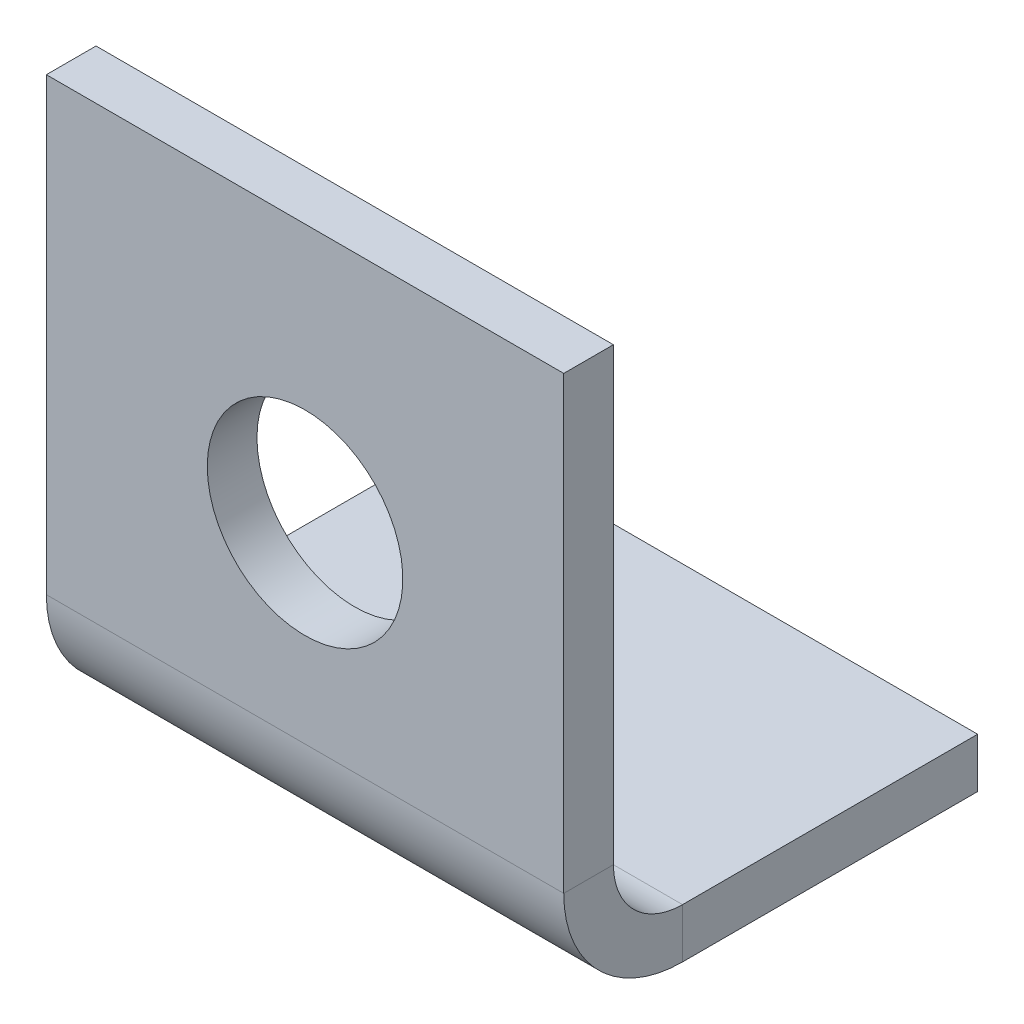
ISO-10303-21;
HEADER;
FILE_DESCRIPTION(('STEP AP214'),'2;1');
FILE_NAME('part.step','',(''),(''),'','','');
FILE_SCHEMA(('AUTOMOTIVE_DESIGN { 1 0 10303 214 1 1 1 1 }'));
ENDSEC;
DATA;
#1=APPLICATION_CONTEXT('core data for automotive mechanical design processes');
#2=APPLICATION_PROTOCOL_DEFINITION('international standard','automotive_design',2000,#1);
#3=PRODUCT_CONTEXT('',#1,'mechanical');
#4=PRODUCT('Part','Part','',(#3));
#5=PRODUCT_RELATED_PRODUCT_CATEGORY('part','',(#4));
#6=PRODUCT_DEFINITION_FORMATION('','',#4);
#7=PRODUCT_DEFINITION_CONTEXT('part definition',#1,'design');
#8=PRODUCT_DEFINITION('design','',#6,#7);
#9=PRODUCT_DEFINITION_SHAPE('','',#8);
#10=(LENGTH_UNIT() NAMED_UNIT(*) SI_UNIT(.MILLI.,.METRE.));
#11=(NAMED_UNIT(*) PLANE_ANGLE_UNIT() SI_UNIT($,.RADIAN.));
#12=(NAMED_UNIT(*) SI_UNIT($,.STERADIAN.) SOLID_ANGLE_UNIT());
#13=UNCERTAINTY_MEASURE_WITH_UNIT(LENGTH_MEASURE(1.E-05),#10,'distance_accuracy_value','');
#14=(GEOMETRIC_REPRESENTATION_CONTEXT(3) GLOBAL_UNCERTAINTY_ASSIGNED_CONTEXT((#13)) GLOBAL_UNIT_ASSIGNED_CONTEXT((#10,
#11,#12)) REPRESENTATION_CONTEXT('',''));
#15=CARTESIAN_POINT('',(0.,0.,0.));
#16=DIRECTION('',(0.,0.,1.));
#17=DIRECTION('',(1.,0.,0.));
#18=AXIS2_PLACEMENT_3D('',#15,#16,#17);
#19=CARTESIAN_POINT('',(-15.875,17.4625,-3.048));
#20=DIRECTION('',(-1.,0.,0.));
#21=DIRECTION('',(0.,-1.,0.));
#22=AXIS2_PLACEMENT_3D('',#19,#20,#21);
#23=PLANE('',#22);
#24=DIRECTION('',(0.,-1.,0.));
#25=VECTOR('',#24,1.);
#26=CARTESIAN_POINT('',(-15.875,17.4625,-3.048));
#27=LINE('',#26,#25);
#28=CARTESIAN_POINT('',(-15.875,17.4625,-3.048));
#29=VERTEX_POINT('',#28);
#30=CARTESIAN_POINT('',(-15.875,-10.1727,-3.048));
#31=VERTEX_POINT('',#30);
#32=EDGE_CURVE('E111',#29,#31,#27,.T.);
#33=ORIENTED_EDGE('',*,*,#32,.T.);
#34=DIRECTION('',(0.,0.,1.));
#35=VECTOR('',#34,1.);
#36=CARTESIAN_POINT('',(-15.875,-10.1727,-3.048));
#37=LINE('',#36,#35);
#38=CARTESIAN_POINT('',(-15.875,-10.1727,0.));
#39=VERTEX_POINT('',#38);
#40=EDGE_CURVE('E102',#31,#39,#37,.T.);
#41=ORIENTED_EDGE('',*,*,#40,.T.);
#42=DIRECTION('',(0.,-1.,0.));
#43=VECTOR('',#42,1.);
#44=CARTESIAN_POINT('',(-15.875,17.4625,0.));
#45=LINE('',#44,#43);
#46=CARTESIAN_POINT('',(-15.875,17.4625,0.));
#47=VERTEX_POINT('',#46);
#48=EDGE_CURVE('E100',#47,#39,#45,.T.);
#49=ORIENTED_EDGE('',*,*,#48,.F.);
#50=DIRECTION('',(0.,0.,1.));
#51=VECTOR('',#50,1.);
#52=CARTESIAN_POINT('',(-15.875,17.4625,-3.048));
#53=LINE('',#52,#51);
#54=EDGE_CURVE('E13',#29,#47,#53,.T.);
#55=ORIENTED_EDGE('',*,*,#54,.F.);
#56=EDGE_LOOP('',(#33,#41,#49,#55));
#57=FACE_BOUND('',#56,.T.);
#58=ADVANCED_FACE('F58',(#57),#23,.T.);
#59=CARTESIAN_POINT('',(0.,0.,-3.048));
#60=DIRECTION('',(0.,0.,1.));
#61=DIRECTION('',(1.,0.,0.));
#62=AXIS2_PLACEMENT_3D('',#59,#60,#61);
#63=PLANE('',#62);
#64=CARTESIAN_POINT('',(0.,1.5875,-3.048));
#65=DIRECTION('',(0.,0.,-1.));
#66=DIRECTION('',(-1.,0.,0.));
#67=AXIS2_PLACEMENT_3D('',#64,#65,#66);
#68=CIRCLE('',#67,6.);
#69=CARTESIAN_POINT('',(-6.,1.5875,-3.048));
#70=VERTEX_POINT('',#69);
#71=EDGE_CURVE('E119',#70,#70,#68,.T.);
#72=ORIENTED_EDGE('',*,*,#71,.F.);
#73=EDGE_LOOP('',(#72));
#74=FACE_BOUND('',#73,.T.);
#75=DIRECTION('',(-1.,0.,0.));
#76=VECTOR('',#75,1.);
#77=CARTESIAN_POINT('',(-15.875,-10.1727,-3.048));
#78=LINE('',#77,#76);
#79=CARTESIAN_POINT('',(15.875,-10.1727,-3.048));
#80=VERTEX_POINT('',#79);
#81=EDGE_CURVE('E130',#31,#80,#78,.F.);
#82=ORIENTED_EDGE('',*,*,#81,.F.);
#83=ORIENTED_EDGE('',*,*,#32,.F.);
#84=DIRECTION('',(-1.,0.,0.));
#85=VECTOR('',#84,1.);
#86=CARTESIAN_POINT('',(-15.875,17.4625,-3.048));
#87=LINE('',#86,#85);
#88=CARTESIAN_POINT('',(15.875,17.4625,-3.048));
#89=VERTEX_POINT('',#88);
#90=EDGE_CURVE('E97',#89,#29,#87,.T.);
#91=ORIENTED_EDGE('',*,*,#90,.F.);
#92=DIRECTION('',(0.,1.,0.));
#93=VECTOR('',#92,1.);
#94=CARTESIAN_POINT('',(15.875,17.4625,-3.048));
#95=LINE('',#94,#93);
#96=EDGE_CURVE('E113',#80,#89,#95,.T.);
#97=ORIENTED_EDGE('',*,*,#96,.F.);
#98=EDGE_LOOP('',(#82,#83,#91,#97));
#99=FACE_BOUND('',#98,.T.);
#100=ADVANCED_FACE('F229',(#74,#99),#63,.F.);
#101=CARTESIAN_POINT('',(0.,0.,0.));
#102=DIRECTION('',(0.,0.,1.));
#103=DIRECTION('',(1.,0.,0.));
#104=AXIS2_PLACEMENT_3D('',#101,#102,#103);
#105=PLANE('',#104);
#106=CARTESIAN_POINT('',(0.,1.5875,0.));
#107=DIRECTION('',(0.,0.,-1.));
#108=DIRECTION('',(-1.,0.,0.));
#109=AXIS2_PLACEMENT_3D('',#106,#107,#108);
#110=CIRCLE('',#109,6.);
#111=CARTESIAN_POINT('',(-6.,1.5875,0.));
#112=VERTEX_POINT('',#111);
#113=EDGE_CURVE('E106',#112,#112,#110,.T.);
#114=ORIENTED_EDGE('',*,*,#113,.T.);
#115=EDGE_LOOP('',(#114));
#116=FACE_BOUND('',#115,.T.);
#117=ORIENTED_EDGE('',*,*,#48,.T.);
#118=DIRECTION('',(-1.,0.,0.));
#119=VECTOR('',#118,1.);
#120=CARTESIAN_POINT('',(-15.875,-10.1727,0.));
#121=LINE('',#120,#119);
#122=CARTESIAN_POINT('',(15.875,-10.1727,0.));
#123=VERTEX_POINT('',#122);
#124=EDGE_CURVE('E140',#39,#123,#121,.F.);
#125=ORIENTED_EDGE('',*,*,#124,.T.);
#126=DIRECTION('',(0.,1.,0.));
#127=VECTOR('',#126,1.);
#128=CARTESIAN_POINT('',(15.875,17.4625,0.));
#129=LINE('',#128,#127);
#130=CARTESIAN_POINT('',(15.875,17.4625,0.));
#131=VERTEX_POINT('',#130);
#132=EDGE_CURVE('E105',#123,#131,#129,.T.);
#133=ORIENTED_EDGE('',*,*,#132,.T.);
#134=DIRECTION('',(-1.,0.,0.));
#135=VECTOR('',#134,1.);
#136=CARTESIAN_POINT('',(-15.875,17.4625,0.));
#137=LINE('',#136,#135);
#138=EDGE_CURVE('E95',#131,#47,#137,.T.);
#139=ORIENTED_EDGE('',*,*,#138,.T.);
#140=EDGE_LOOP('',(#117,#125,#133,#139));
#141=FACE_BOUND('',#140,.T.);
#142=ADVANCED_FACE('F108',(#116,#141),#105,.T.);
#143=CARTESIAN_POINT('',(-15.875,17.4625,-3.048));
#144=DIRECTION('',(0.,1.,0.));
#145=DIRECTION('',(0.,0.,1.));
#146=AXIS2_PLACEMENT_3D('',#143,#144,#145);
#147=PLANE('',#146);
#148=ORIENTED_EDGE('',*,*,#138,.F.);
#149=DIRECTION('',(0.,0.,1.));
#150=VECTOR('',#149,1.);
#151=CARTESIAN_POINT('',(15.875,17.4625,-3.048));
#152=LINE('',#151,#150);
#153=EDGE_CURVE('E61',#89,#131,#152,.T.);
#154=ORIENTED_EDGE('',*,*,#153,.F.);
#155=ORIENTED_EDGE('',*,*,#90,.T.);
#156=ORIENTED_EDGE('',*,*,#54,.T.);
#157=EDGE_LOOP('',(#148,#154,#155,#156));
#158=FACE_BOUND('',#157,.T.);
#159=ADVANCED_FACE('F92',(#158),#147,.T.);
#160=CARTESIAN_POINT('',(15.875,17.4625,-3.048));
#161=DIRECTION('',(1.,0.,0.));
#162=DIRECTION('',(0.,0.,-1.));
#163=AXIS2_PLACEMENT_3D('',#160,#161,#162);
#164=PLANE('',#163);
#165=DIRECTION('',(0.,0.,1.));
#166=VECTOR('',#165,1.);
#167=CARTESIAN_POINT('',(15.875,-10.1727,-3.048));
#168=LINE('',#167,#166);
#169=EDGE_CURVE('E122',#80,#123,#168,.T.);
#170=ORIENTED_EDGE('',*,*,#169,.F.);
#171=ORIENTED_EDGE('',*,*,#96,.T.);
#172=ORIENTED_EDGE('',*,*,#153,.T.);
#173=ORIENTED_EDGE('',*,*,#132,.F.);
#174=EDGE_LOOP('',(#170,#171,#172,#173));
#175=FACE_BOUND('',#174,.T.);
#176=ADVANCED_FACE('F232',(#175),#164,.T.);
#177=CARTESIAN_POINT('',(0.,1.5875,0.));
#178=DIRECTION('',(0.,0.,-1.));
#179=DIRECTION('',(-1.,0.,0.));
#180=AXIS2_PLACEMENT_3D('',#177,#178,#179);
#181=CYLINDRICAL_SURFACE('',#180,6.);
#182=CARTESIAN_POINT('',(-6.,1.5875,0.));
#183=CARTESIAN_POINT('',(-6.,1.5875,-0.03175));
#184=CARTESIAN_POINT('',(-6.,1.5875,-0.0635));
#185=CARTESIAN_POINT('',(-6.,1.5875,-0.127));
#186=CARTESIAN_POINT('',(-6.,1.5875,-0.15875));
#187=CARTESIAN_POINT('',(-6.,1.5875,-0.22225));
#188=CARTESIAN_POINT('',(-6.,1.5875,-0.254));
#189=CARTESIAN_POINT('',(-6.,1.5875,-0.3175));
#190=CARTESIAN_POINT('',(-6.,1.5875,-0.34925));
#191=CARTESIAN_POINT('',(-6.,1.5875,-0.41275));
#192=CARTESIAN_POINT('',(-6.,1.5875,-0.4445));
#193=CARTESIAN_POINT('',(-6.,1.5875,-0.508));
#194=CARTESIAN_POINT('',(-6.,1.5875,-0.53975));
#195=CARTESIAN_POINT('',(-6.,1.5875,-0.60325));
#196=CARTESIAN_POINT('',(-6.,1.5875,-0.635));
#197=CARTESIAN_POINT('',(-6.,1.5875,-0.6985));
#198=CARTESIAN_POINT('',(-6.,1.5875,-0.73025));
#199=CARTESIAN_POINT('',(-6.,1.5875,-0.79375));
#200=CARTESIAN_POINT('',(-6.,1.5875,-0.8255));
#201=CARTESIAN_POINT('',(-6.,1.5875,-0.889));
#202=CARTESIAN_POINT('',(-6.,1.5875,-0.92075));
#203=CARTESIAN_POINT('',(-6.,1.5875,-0.98425));
#204=CARTESIAN_POINT('',(-6.,1.5875,-1.016));
#205=CARTESIAN_POINT('',(-6.,1.5875,-1.0795));
#206=CARTESIAN_POINT('',(-6.,1.5875,-1.11125));
#207=CARTESIAN_POINT('',(-6.,1.5875,-1.17475));
#208=CARTESIAN_POINT('',(-6.,1.5875,-1.2065));
#209=CARTESIAN_POINT('',(-6.,1.5875,-1.27));
#210=CARTESIAN_POINT('',(-6.,1.5875,-1.30175));
#211=CARTESIAN_POINT('',(-6.,1.5875,-1.36525));
#212=CARTESIAN_POINT('',(-6.,1.5875,-1.397));
#213=CARTESIAN_POINT('',(-6.,1.5875,-1.4605));
#214=CARTESIAN_POINT('',(-6.,1.5875,-1.49225));
#215=CARTESIAN_POINT('',(-6.,1.5875,-1.55575));
#216=CARTESIAN_POINT('',(-6.,1.5875,-1.5875));
#217=CARTESIAN_POINT('',(-6.,1.5875,-1.651));
#218=CARTESIAN_POINT('',(-6.,1.5875,-1.68275));
#219=CARTESIAN_POINT('',(-6.,1.5875,-1.74625));
#220=CARTESIAN_POINT('',(-6.,1.5875,-1.778));
#221=CARTESIAN_POINT('',(-6.,1.5875,-1.8415));
#222=CARTESIAN_POINT('',(-6.,1.5875,-1.87325));
#223=CARTESIAN_POINT('',(-6.,1.5875,-1.93675));
#224=CARTESIAN_POINT('',(-6.,1.5875,-1.9685));
#225=CARTESIAN_POINT('',(-6.,1.5875,-2.032));
#226=CARTESIAN_POINT('',(-6.,1.5875,-2.06375));
#227=CARTESIAN_POINT('',(-6.,1.5875,-2.12725));
#228=CARTESIAN_POINT('',(-6.,1.5875,-2.159));
#229=CARTESIAN_POINT('',(-6.,1.5875,-2.2225));
#230=CARTESIAN_POINT('',(-6.,1.5875,-2.25425));
#231=CARTESIAN_POINT('',(-6.,1.5875,-2.31775));
#232=CARTESIAN_POINT('',(-6.,1.5875,-2.3495));
#233=CARTESIAN_POINT('',(-6.,1.5875,-2.413));
#234=CARTESIAN_POINT('',(-6.,1.5875,-2.44475));
#235=CARTESIAN_POINT('',(-6.,1.5875,-2.50825));
#236=CARTESIAN_POINT('',(-6.,1.5875,-2.54));
#237=CARTESIAN_POINT('',(-6.,1.5875,-2.6035));
#238=CARTESIAN_POINT('',(-6.,1.5875,-2.63525));
#239=CARTESIAN_POINT('',(-6.,1.5875,-2.69875));
#240=CARTESIAN_POINT('',(-6.,1.5875,-2.7305));
#241=CARTESIAN_POINT('',(-6.,1.5875,-2.794));
#242=CARTESIAN_POINT('',(-6.,1.5875,-2.82575));
#243=CARTESIAN_POINT('',(-6.,1.5875,-2.88925));
#244=CARTESIAN_POINT('',(-6.,1.5875,-2.921));
#245=CARTESIAN_POINT('',(-6.,1.5875,-2.9845));
#246=CARTESIAN_POINT('',(-6.,1.5875,-3.01625));
#247=CARTESIAN_POINT('',(-6.,1.5875,-3.048));
#248=B_SPLINE_CURVE_WITH_KNOTS('',3,(#182,#183,#184,#185,#186,#187,#188,#189,#190,#191,#192,
#193,#194,#195,#196,#197,#198,#199,#200,#201,#202,#203,#204,#205,#206,#207,#208,#209,#210,#211,
#212,#213,#214,#215,#216,#217,#218,#219,#220,#221,#222,#223,#224,#225,#226,#227,#228,#229,#230,
#231,#232,#233,#234,#235,#236,#237,#238,#239,#240,#241,#242,#243,#244,#245,#246,#247),
.UNSPECIFIED.,.F.,.F.,(4,2,2,2,2,2,2,2,2,2,2,2,2,2,2,2,2,2,2,2,2,2,2,2,2,2,2,2,2,2,2,2,4),(0.,
0.09525,0.1905,0.28575,0.381,0.47625,0.5715,0.66675,0.762,0.85725,0.9525,1.04775,1.143,1.23825,
1.3335,1.42875,1.524,1.61925,1.7145,1.80975,1.905,2.00025,2.0955,2.19075,2.286,2.38125,2.4765,
2.57175,2.667,2.76225,2.8575,2.95275,3.048),.UNSPECIFIED.);
#249=EDGE_CURVE('BSEAM257',#112,#70,#248,.T.);
#250=ORIENTED_EDGE('',*,*,#113,.F.);
#251=ORIENTED_EDGE('',*,*,#71,.T.);
#252=ORIENTED_EDGE('',*,*,#249,.T.);
#253=ORIENTED_EDGE('',*,*,#249,.F.);
#254=EDGE_LOOP('',(#250,#252,#251,#253));
#255=FACE_BOUND('',#254,.T.);
#256=ADVANCED_FACE('F257',(#255),#181,.F.);
#257=CARTESIAN_POINT('',(15.875,-10.1727,-7.2898));
#258=DIRECTION('',(1.,0.,0.));
#259=DIRECTION('',(0.,0.,-1.));
#260=AXIS2_PLACEMENT_3D('',#257,#258,#259);
#261=PLANE('',#260);
#262=DIRECTION('',(0.,1.,0.));
#263=VECTOR('',#262,1.);
#264=CARTESIAN_POINT('',(15.875,-17.4625,-7.28979999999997));
#265=LINE('',#264,#263);
#266=CARTESIAN_POINT('',(15.875,-14.4145,-7.28979999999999));
#267=VERTEX_POINT('',#266);
#268=CARTESIAN_POINT('',(15.875,-17.4625,-7.28979999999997));
#269=VERTEX_POINT('',#268);
#270=EDGE_CURVE('E143',#267,#269,#265,.F.);
#271=ORIENTED_EDGE('',*,*,#270,.F.);
#272=CARTESIAN_POINT('',(15.875,-10.1727,-7.2898));
#273=DIRECTION('',(-1.,0.,0.));
#274=DIRECTION('',(0.,0.,1.));
#275=AXIS2_PLACEMENT_3D('',#272,#273,#274);
#276=CIRCLE('',#275,4.2418);
#277=EDGE_CURVE('E134',#80,#267,#276,.F.);
#278=ORIENTED_EDGE('',*,*,#277,.F.);
#279=ORIENTED_EDGE('',*,*,#169,.T.);
#280=CARTESIAN_POINT('',(15.875,-10.1727,-7.2898));
#281=DIRECTION('',(-1.,0.,0.));
#282=DIRECTION('',(0.,0.,1.));
#283=AXIS2_PLACEMENT_3D('',#280,#281,#282);
#284=CIRCLE('',#283,7.2898);
#285=EDGE_CURVE('E72',#123,#269,#284,.F.);
#286=ORIENTED_EDGE('',*,*,#285,.T.);
#287=EDGE_LOOP('',(#271,#278,#279,#286));
#288=FACE_BOUND('',#287,.T.);
#289=ADVANCED_FACE('F233',(#288),#261,.T.);
#290=CARTESIAN_POINT('',(-15.875,-10.1727,-7.2898));
#291=DIRECTION('',(1.,0.,0.));
#292=DIRECTION('',(0.,0.,-1.));
#293=AXIS2_PLACEMENT_3D('',#290,#291,#292);
#294=PLANE('',#293);
#295=CARTESIAN_POINT('',(-15.875,-10.1727,-7.2898));
#296=DIRECTION('',(-1.,0.,0.));
#297=DIRECTION('',(0.,0.,1.));
#298=AXIS2_PLACEMENT_3D('',#295,#296,#297);
#299=CIRCLE('',#298,4.2418);
#300=CARTESIAN_POINT('',(-15.875,-14.4145,-7.28979999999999));
#301=VERTEX_POINT('',#300);
#302=EDGE_CURVE('E127',#301,#31,#299,.T.);
#303=ORIENTED_EDGE('',*,*,#302,.F.);
#304=DIRECTION('',(0.,1.,0.));
#305=VECTOR('',#304,1.);
#306=CARTESIAN_POINT('',(-15.875,-14.4145,-7.28979999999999));
#307=LINE('',#306,#305);
#308=CARTESIAN_POINT('',(-15.875,-17.4625,-7.28979999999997));
#309=VERTEX_POINT('',#308);
#310=EDGE_CURVE('E149',#301,#309,#307,.F.);
#311=ORIENTED_EDGE('',*,*,#310,.T.);
#312=CARTESIAN_POINT('',(-15.875,-10.1727,-7.2898));
#313=DIRECTION('',(-1.,0.,0.));
#314=DIRECTION('',(0.,0.,1.));
#315=AXIS2_PLACEMENT_3D('',#312,#313,#314);
#316=CIRCLE('',#315,7.2898);
#317=EDGE_CURVE('E137',#309,#39,#316,.T.);
#318=ORIENTED_EDGE('',*,*,#317,.T.);
#319=ORIENTED_EDGE('',*,*,#40,.F.);
#320=EDGE_LOOP('',(#303,#311,#318,#319));
#321=FACE_BOUND('',#320,.T.);
#322=ADVANCED_FACE('F223',(#321),#294,.F.);
#323=CARTESIAN_POINT('',(-15.875,-10.1727,-7.2898));
#324=DIRECTION('',(-1.,0.,0.));
#325=DIRECTION('',(0.,-1.,0.));
#326=AXIS2_PLACEMENT_3D('',#323,#324,#325);
#327=CYLINDRICAL_SURFACE('',#326,7.2898);
#328=ORIENTED_EDGE('',*,*,#124,.F.);
#329=ORIENTED_EDGE('',*,*,#317,.F.);
#330=DIRECTION('',(-1.,0.,0.));
#331=VECTOR('',#330,1.);
#332=CARTESIAN_POINT('',(15.875,-17.4625,-7.28979999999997));
#333=LINE('',#332,#331);
#334=EDGE_CURVE('E152',#309,#269,#333,.F.);
#335=ORIENTED_EDGE('',*,*,#334,.T.);
#336=ORIENTED_EDGE('',*,*,#285,.F.);
#337=EDGE_LOOP('',(#328,#329,#335,#336));
#338=FACE_BOUND('',#337,.T.);
#339=ADVANCED_FACE('F234',(#338),#327,.T.);
#340=CARTESIAN_POINT('',(-15.875,-10.1727,-7.2898));
#341=DIRECTION('',(-1.,0.,0.));
#342=DIRECTION('',(0.,-1.,0.));
#343=AXIS2_PLACEMENT_3D('',#340,#341,#342);
#344=CYLINDRICAL_SURFACE('',#343,4.2418);
#345=ORIENTED_EDGE('',*,*,#81,.T.);
#346=ORIENTED_EDGE('',*,*,#277,.T.);
#347=DIRECTION('',(-1.,0.,0.));
#348=VECTOR('',#347,1.);
#349=CARTESIAN_POINT('',(15.875,-14.4145,-7.28979999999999));
#350=LINE('',#349,#348);
#351=EDGE_CURVE('E146',#267,#301,#350,.T.);
#352=ORIENTED_EDGE('',*,*,#351,.T.);
#353=ORIENTED_EDGE('',*,*,#302,.T.);
#354=EDGE_LOOP('',(#345,#346,#352,#353));
#355=FACE_BOUND('',#354,.T.);
#356=ADVANCED_FACE('F226',(#355),#344,.F.);
#357=CARTESIAN_POINT('',(-15.875,-17.4625000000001,-25.4));
#358=DIRECTION('',(1.,0.,0.));
#359=DIRECTION('',(0.,0.,-1.));
#360=AXIS2_PLACEMENT_3D('',#357,#358,#359);
#361=PLANE('',#360);
#362=ORIENTED_EDGE('',*,*,#310,.F.);
#363=DIRECTION('',(0.,0.,1.));
#364=VECTOR('',#363,1.);
#365=CARTESIAN_POINT('',(-15.875,-14.4145000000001,-25.4));
#366=LINE('',#365,#364);
#367=CARTESIAN_POINT('',(-15.875,-14.4145000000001,-25.4));
#368=VERTEX_POINT('',#367);
#369=EDGE_CURVE('E154',#301,#368,#366,.F.);
#370=ORIENTED_EDGE('',*,*,#369,.T.);
#371=DIRECTION('',(0.,1.,0.));
#372=VECTOR('',#371,1.);
#373=CARTESIAN_POINT('',(-15.875,-17.4625000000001,-25.4));
#374=LINE('',#373,#372);
#375=CARTESIAN_POINT('',(-15.875,-17.4625000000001,-25.4));
#376=VERTEX_POINT('',#375);
#377=EDGE_CURVE('E131',#376,#368,#374,.T.);
#378=ORIENTED_EDGE('',*,*,#377,.F.);
#379=DIRECTION('',(0.,0.,-1.));
#380=VECTOR('',#379,1.);
#381=CARTESIAN_POINT('',(-15.875,-17.4625,0.));
#382=LINE('',#381,#380);
#383=EDGE_CURVE('E163',#309,#376,#382,.T.);
#384=ORIENTED_EDGE('',*,*,#383,.F.);
#385=EDGE_LOOP('',(#362,#370,#378,#384));
#386=FACE_BOUND('',#385,.T.);
#387=ADVANCED_FACE('F220',(#386),#361,.F.);
#388=CARTESIAN_POINT('',(15.875,-17.4625,-3.04799999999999));
#389=DIRECTION('',(-1.,0.,0.));
#390=DIRECTION('',(0.,0.,1.));
#391=AXIS2_PLACEMENT_3D('',#388,#389,#390);
#392=PLANE('',#391);
#393=ORIENTED_EDGE('',*,*,#270,.T.);
#394=DIRECTION('',(0.,0.,1.));
#395=VECTOR('',#394,1.);
#396=CARTESIAN_POINT('',(15.875,-17.4625,0.));
#397=LINE('',#396,#395);
#398=CARTESIAN_POINT('',(15.875,-17.4625000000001,-25.4));
#399=VERTEX_POINT('',#398);
#400=EDGE_CURVE('E169',#399,#269,#397,.T.);
#401=ORIENTED_EDGE('',*,*,#400,.F.);
#402=DIRECTION('',(0.,1.,0.));
#403=VECTOR('',#402,1.);
#404=CARTESIAN_POINT('',(15.875,-17.4625000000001,-25.4));
#405=LINE('',#404,#403);
#406=CARTESIAN_POINT('',(15.875,-14.4145000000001,-25.4));
#407=VERTEX_POINT('',#406);
#408=EDGE_CURVE('E172',#399,#407,#405,.T.);
#409=ORIENTED_EDGE('',*,*,#408,.T.);
#410=DIRECTION('',(0.,0.,-1.));
#411=VECTOR('',#410,1.);
#412=CARTESIAN_POINT('',(15.875,-14.4145,-3.048));
#413=LINE('',#412,#411);
#414=EDGE_CURVE('E160',#407,#267,#413,.F.);
#415=ORIENTED_EDGE('',*,*,#414,.T.);
#416=EDGE_LOOP('',(#393,#401,#409,#415));
#417=FACE_BOUND('',#416,.T.);
#418=ADVANCED_FACE('F198',(#417),#392,.F.);
#419=CARTESIAN_POINT('',(0.,-17.4625,0.));
#420=DIRECTION('',(0.,1.,0.));
#421=DIRECTION('',(0.,0.,1.));
#422=AXIS2_PLACEMENT_3D('',#419,#420,#421);
#423=PLANE('',#422);
#424=ORIENTED_EDGE('',*,*,#334,.F.);
#425=ORIENTED_EDGE('',*,*,#383,.T.);
#426=DIRECTION('',(1.,0.,0.));
#427=VECTOR('',#426,1.);
#428=CARTESIAN_POINT('',(0.,-17.4625000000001,-25.4));
#429=LINE('',#428,#427);
#430=EDGE_CURVE('E166',#376,#399,#429,.T.);
#431=ORIENTED_EDGE('',*,*,#430,.T.);
#432=ORIENTED_EDGE('',*,*,#400,.T.);
#433=EDGE_LOOP('',(#424,#425,#431,#432));
#434=FACE_BOUND('',#433,.T.);
#435=ADVANCED_FACE('F218',(#434),#423,.F.);
#436=CARTESIAN_POINT('',(0.,-14.4145,0.));
#437=DIRECTION('',(0.,1.,0.));
#438=DIRECTION('',(0.,0.,1.));
#439=AXIS2_PLACEMENT_3D('',#436,#437,#438);
#440=PLANE('',#439);
#441=ORIENTED_EDGE('',*,*,#369,.F.);
#442=ORIENTED_EDGE('',*,*,#351,.F.);
#443=ORIENTED_EDGE('',*,*,#414,.F.);
#444=DIRECTION('',(-1.,0.,0.));
#445=VECTOR('',#444,1.);
#446=CARTESIAN_POINT('',(15.875,-14.4145000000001,-25.4));
#447=LINE('',#446,#445);
#448=EDGE_CURVE('E157',#368,#407,#447,.F.);
#449=ORIENTED_EDGE('',*,*,#448,.F.);
#450=EDGE_LOOP('',(#441,#442,#443,#449));
#451=FACE_BOUND('',#450,.T.);
#452=ADVANCED_FACE('F192',(#451),#440,.T.);
#453=CARTESIAN_POINT('',(15.875,-17.4625000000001,-25.4));
#454=DIRECTION('',(0.,0.,1.));
#455=DIRECTION('',(0.,-1.,0.));
#456=AXIS2_PLACEMENT_3D('',#453,#454,#455);
#457=PLANE('',#456);
#458=ORIENTED_EDGE('',*,*,#448,.T.);
#459=ORIENTED_EDGE('',*,*,#408,.F.);
#460=ORIENTED_EDGE('',*,*,#430,.F.);
#461=ORIENTED_EDGE('',*,*,#377,.T.);
#462=EDGE_LOOP('',(#458,#459,#460,#461));
#463=FACE_BOUND('',#462,.T.);
#464=ADVANCED_FACE('F181',(#463),#457,.F.);
#465=CLOSED_SHELL('',(#58,#100,#142,#159,#176,#256,#289,#322,#339,#356,#387,#418,#435,#452,#464));
#466=MANIFOLD_SOLID_BREP('B2',#465);
#467=ADVANCED_BREP_SHAPE_REPRESENTATION('',(#18,#466),#14);
#468=SHAPE_DEFINITION_REPRESENTATION(#9,#467);
ENDSEC;
END-ISO-10303-21;
